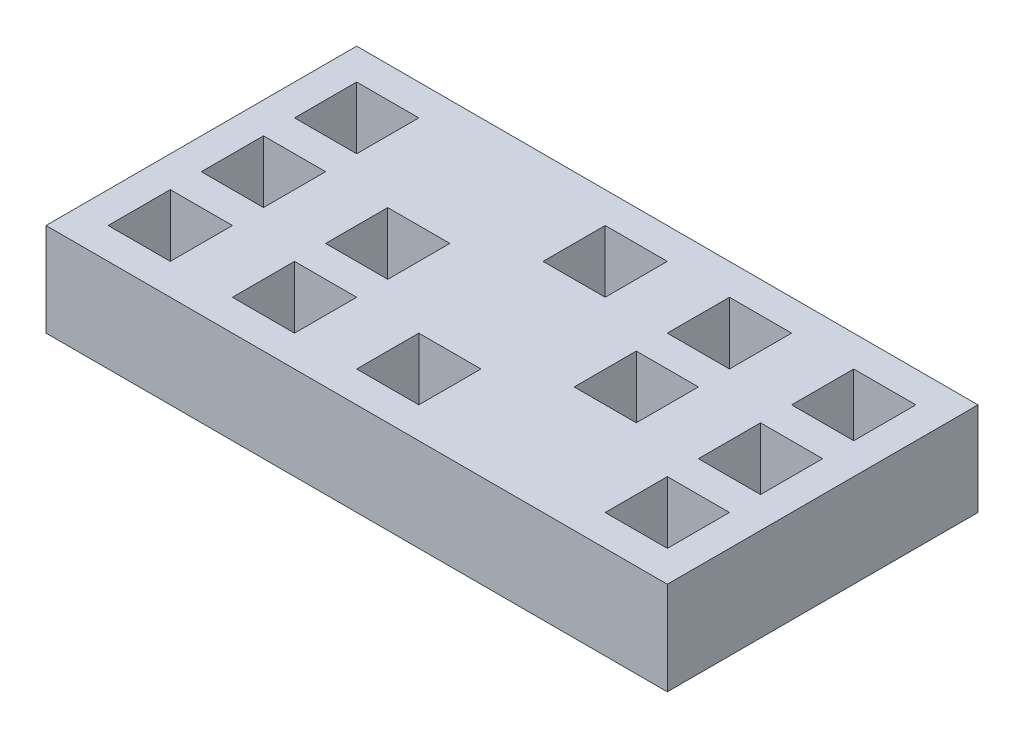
from build123d import *

# Parameters (mm, degrees)
SKETCH1_W      = 100
SKETCH1_H      = 50
SKETCH1_W_2    = 10
SKETCH1_H_2    = 10
EXTRUDE1_DEPTH = 7.5


with BuildPart() as part:
    # Sketch1 → Extrude1 (new, symmetric)
    with BuildSketch(Plane(origin=(0, 0, 0), x_dir=(1, 0, 0), z_dir=(0, 1, 0))):
        with Locations((50, 25)):
            Rectangle(SKETCH1_W, SKETCH1_H)
        with Locations((30, 10)):
            Rectangle(SKETCH1_W_2, SKETCH1_H_2, mode=Mode.SUBTRACT)
        with Locations((10, 10)):
            Rectangle(SKETCH1_W_2, SKETCH1_H_2, mode=Mode.SUBTRACT)
        with Locations((50, 10)):
            Rectangle(SKETCH1_W_2, SKETCH1_H_2, mode=Mode.SUBTRACT)
        with Locations((90, 10)):
            Rectangle(SKETCH1_W_2, SKETCH1_H_2, mode=Mode.SUBTRACT)
        with Locations((10, 25)):
            Rectangle(SKETCH1_W_2, SKETCH1_H_2, mode=Mode.SUBTRACT)
        with Locations((30, 25)):
            Rectangle(SKETCH1_W_2, SKETCH1_H_2, mode=Mode.SUBTRACT)
        with Locations((70, 25)):
            Rectangle(SKETCH1_W_2, SKETCH1_H_2, mode=Mode.SUBTRACT)
        with Locations((90, 25)):
            Rectangle(SKETCH1_W_2, SKETCH1_H_2, mode=Mode.SUBTRACT)
        with Locations((10, 40)):
            Rectangle(SKETCH1_W_2, SKETCH1_H_2, mode=Mode.SUBTRACT)
        with Locations((50, 40)):
            Rectangle(SKETCH1_W_2, SKETCH1_H_2, mode=Mode.SUBTRACT)
        with Locations((70, 40)):
            Rectangle(SKETCH1_W_2, SKETCH1_H_2, mode=Mode.SUBTRACT)
        with Locations((90, 40)):
            Rectangle(SKETCH1_W_2, SKETCH1_H_2, mode=Mode.SUBTRACT)
    extrude(amount=EXTRUDE1_DEPTH, both=True)


solid = part.part
